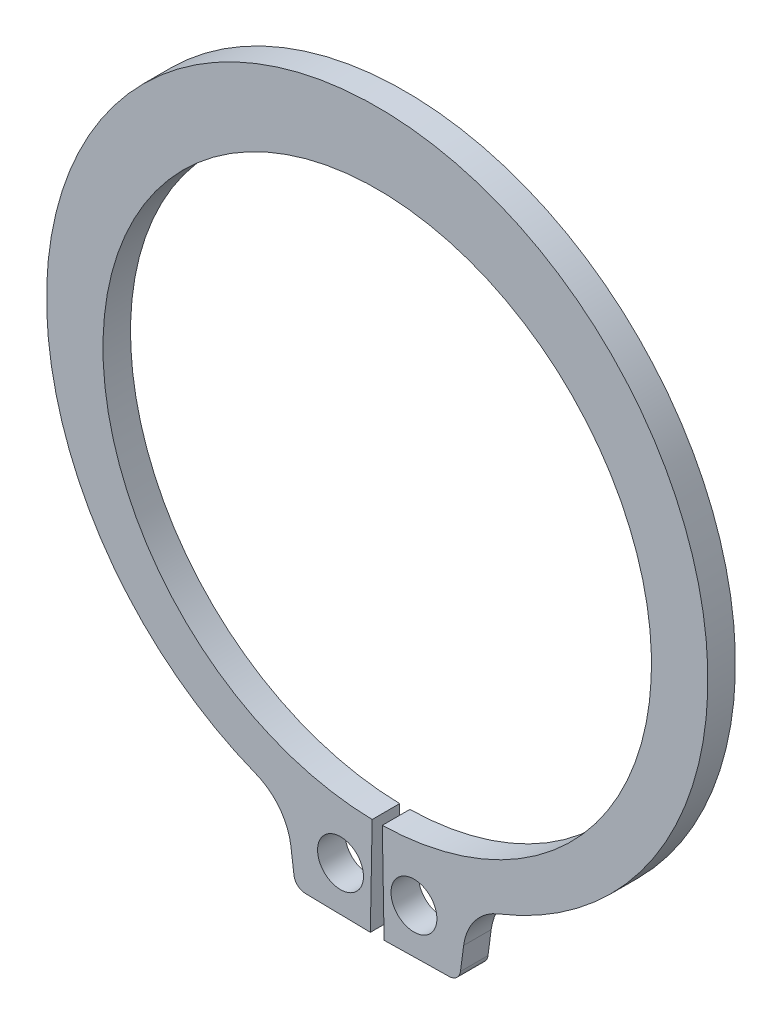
from build123d import *

# Parameters (mm, degrees)
BODYSKE_R  = 1
BODY_DEPTH = 1.2


with BuildPart() as part:
    # BodySke → Body (new body)
    with BuildSketch(Plane.XY):
        with BuildLine():
            Line((0.220615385, -11.947963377), (0.3, -16.247230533))
            Line((0.3, -16.247230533), (3.139981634, -16.194791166))
            ThreePointArc((3.139981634, -16.194791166), (3.463879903, -16.067737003), (3.626473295, -15.760139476))
            Line((3.626473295, -15.760139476), (3.764856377, -14.709015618))
            ThreePointArc((3.764856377, -14.709015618), (4.260723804, -13.526008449), (5.288168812, -12.758058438))
            ThreePointArc((5.288168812, -12.758058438), (0, 15.05), (-5.288168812, -12.758058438))
            ThreePointArc((-5.288168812, -12.758058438), (-4.260723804, -13.526008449), (-3.764856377, -14.709015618))
            Line((-3.764856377, -14.709015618), (-3.626473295, -15.760139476))
            ThreePointArc((-3.626473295, -15.760139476), (-3.463879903, -16.067737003), (-3.139981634, -16.194791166))
            Line((-3.139981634, -16.194791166), (-0.3, -16.247230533))
            Line((-0.3, -16.247230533), (-0.220615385, -11.947963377))
            ThreePointArc((-0.220615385, -11.947963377), (0, 11.95), (0.220615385, -11.947963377))
        make_face()
        with Locations((1.6, -14.285679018)):
            Circle(BODYSKE_R, mode=Mode.SUBTRACT)
        with Locations((-1.6, -14.285679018)):
            Circle(BODYSKE_R, mode=Mode.SUBTRACT)
    extrude(amount=-BODY_DEPTH)


solid = part.part
